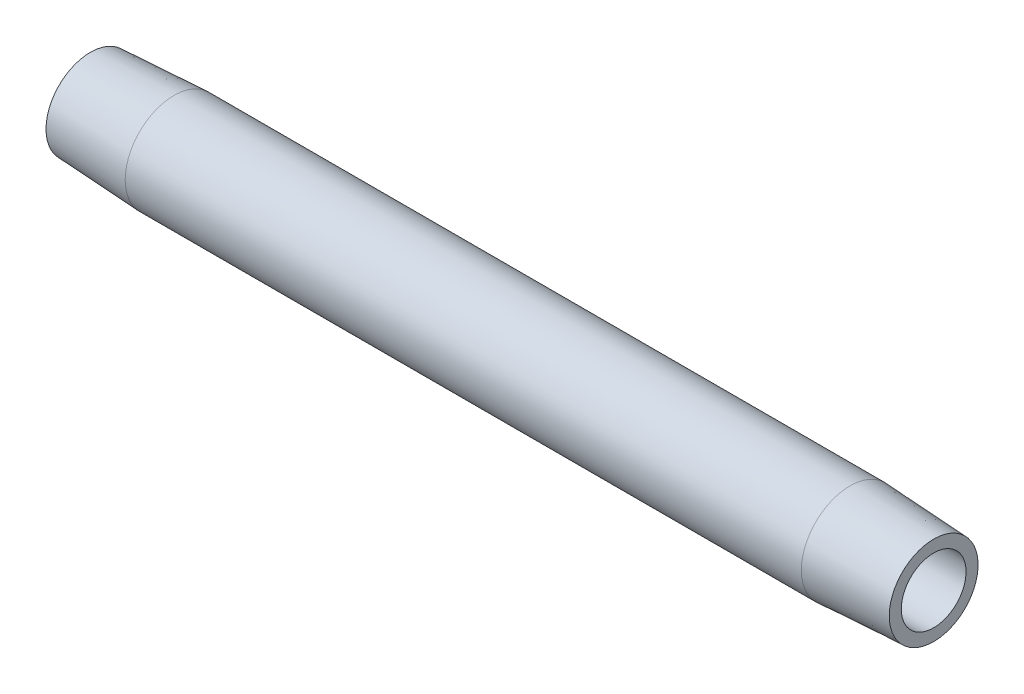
ISO-10303-21;
HEADER;
FILE_DESCRIPTION(('STEP AP214'),'2;1');
FILE_NAME('part.step','',(''),(''),'','','');
FILE_SCHEMA(('AUTOMOTIVE_DESIGN { 1 0 10303 214 1 1 1 1 }'));
ENDSEC;
DATA;
#1=APPLICATION_CONTEXT('core data for automotive mechanical design processes');
#2=APPLICATION_PROTOCOL_DEFINITION('international standard','automotive_design',2000,#1);
#3=PRODUCT_CONTEXT('',#1,'mechanical');
#4=PRODUCT('Part','Part','',(#3));
#5=PRODUCT_RELATED_PRODUCT_CATEGORY('part','',(#4));
#6=PRODUCT_DEFINITION_FORMATION('','',#4);
#7=PRODUCT_DEFINITION_CONTEXT('part definition',#1,'design');
#8=PRODUCT_DEFINITION('design','',#6,#7);
#9=PRODUCT_DEFINITION_SHAPE('','',#8);
#10=(LENGTH_UNIT() NAMED_UNIT(*) SI_UNIT(.MILLI.,.METRE.));
#11=(NAMED_UNIT(*) PLANE_ANGLE_UNIT() SI_UNIT($,.RADIAN.));
#12=(NAMED_UNIT(*) SI_UNIT($,.STERADIAN.) SOLID_ANGLE_UNIT());
#13=UNCERTAINTY_MEASURE_WITH_UNIT(LENGTH_MEASURE(1.E-05),#10,'distance_accuracy_value','');
#14=(GEOMETRIC_REPRESENTATION_CONTEXT(3) GLOBAL_UNCERTAINTY_ASSIGNED_CONTEXT((#13)) GLOBAL_UNIT_ASSIGNED_CONTEXT((#10,
#11,#12)) REPRESENTATION_CONTEXT('',''));
#15=CARTESIAN_POINT('',(0.,0.,0.));
#16=DIRECTION('',(0.,0.,1.));
#17=DIRECTION('',(1.,0.,0.));
#18=AXIS2_PLACEMENT_3D('',#15,#16,#17);
#19=CARTESIAN_POINT('',(0.476141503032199,0.,0.));
#20=DIRECTION('',(-1.,0.,0.));
#21=DIRECTION('',(0.,0.,1.));
#22=AXIS2_PLACEMENT_3D('',#19,#20,#21);
#23=CYLINDRICAL_SURFACE('',#22,5.14349999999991);
#24=CARTESIAN_POINT('',(8.8100393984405,0.,0.));
#25=DIRECTION('',(-1.,0.,0.));
#26=DIRECTION('',(0.,0.,1.));
#27=AXIS2_PLACEMENT_3D('',#24,#25,#26);
#28=CIRCLE('',#27,5.14349999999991);
#29=CARTESIAN_POINT('',(8.8100393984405,0.,5.14349999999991));
#30=VERTEX_POINT('',#29);
#31=EDGE_CURVE('E10',#30,#30,#28,.T.);
#32=ORIENTED_EDGE('',*,*,#31,.F.);
#33=EDGE_LOOP('',(#32));
#34=FACE_BOUND('',#33,.T.);
#35=CARTESIAN_POINT('',(80.0899606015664,0.,0.));
#36=DIRECTION('',(-1.,0.,0.));
#37=DIRECTION('',(0.,0.,1.));
#38=AXIS2_PLACEMENT_3D('',#35,#36,#37);
#39=CIRCLE('',#38,5.14349999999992);
#40=CARTESIAN_POINT('',(80.0899606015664,0.,5.14349999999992));
#41=VERTEX_POINT('',#40);
#42=EDGE_CURVE('E52',#41,#41,#39,.T.);
#43=ORIENTED_EDGE('',*,*,#42,.T.);
#44=EDGE_LOOP('',(#43));
#45=FACE_BOUND('',#44,.T.);
#46=ADVANCED_FACE('F30',(#34,#45),#23,.T.);
#47=CARTESIAN_POINT('',(8.8100393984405,0.,0.));
#48=DIRECTION('',(1.,0.,0.));
#49=DIRECTION('',(0.,0.,-1.));
#50=AXIS2_PLACEMENT_3D('',#47,#48,#49);
#51=CONICAL_SURFACE('',#50,5.14349999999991,0.0523598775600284);
#52=CARTESIAN_POINT('',(0.,0.,0.));
#53=DIRECTION('',(-1.,0.,0.));
#54=DIRECTION('',(0.,0.,1.));
#55=AXIS2_PLACEMENT_3D('',#52,#53,#54);
#56=CIRCLE('',#55,4.68178539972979);
#57=CARTESIAN_POINT('',(0.,0.,4.68178539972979));
#58=VERTEX_POINT('',#57);
#59=EDGE_CURVE('E36',#58,#58,#56,.T.);
#60=ORIENTED_EDGE('',*,*,#59,.F.);
#61=EDGE_LOOP('',(#60));
#62=FACE_BOUND('',#61,.T.);
#63=ORIENTED_EDGE('',*,*,#31,.T.);
#64=EDGE_LOOP('',(#63));
#65=FACE_BOUND('',#64,.T.);
#66=ADVANCED_FACE('F77',(#62,#65),#51,.T.);
#67=CARTESIAN_POINT('',(0.,4.68178539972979,0.));
#68=DIRECTION('',(1.,0.,0.));
#69=DIRECTION('',(0.,0.,-1.));
#70=AXIS2_PLACEMENT_3D('',#67,#68,#69);
#71=PLANE('',#70);
#72=CARTESIAN_POINT('',(0.,0.,0.));
#73=DIRECTION('',(-1.,0.,0.));
#74=DIRECTION('',(0.,0.,1.));
#75=AXIS2_PLACEMENT_3D('',#72,#73,#74);
#76=CIRCLE('',#75,3.4163);
#77=CARTESIAN_POINT('',(0.,0.,3.4163));
#78=VERTEX_POINT('',#77);
#79=EDGE_CURVE('E40',#78,#78,#76,.T.);
#80=ORIENTED_EDGE('',*,*,#79,.F.);
#81=EDGE_LOOP('',(#80));
#82=FACE_BOUND('',#81,.T.);
#83=ORIENTED_EDGE('',*,*,#59,.T.);
#84=EDGE_LOOP('',(#83));
#85=FACE_BOUND('',#84,.T.);
#86=ADVANCED_FACE('F72',(#82,#85),#71,.F.);
#87=CARTESIAN_POINT('',(0.476141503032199,0.,0.));
#88=DIRECTION('',(-1.,0.,0.));
#89=DIRECTION('',(0.,0.,1.));
#90=AXIS2_PLACEMENT_3D('',#87,#88,#89);
#91=CYLINDRICAL_SURFACE('',#90,3.4163);
#92=CARTESIAN_POINT('',(88.9,0.,0.));
#93=DIRECTION('',(-1.,0.,0.));
#94=DIRECTION('',(0.,0.,1.));
#95=AXIS2_PLACEMENT_3D('',#92,#93,#94);
#96=CIRCLE('',#95,3.41630000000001);
#97=CARTESIAN_POINT('',(88.9,0.,3.41630000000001));
#98=VERTEX_POINT('',#97);
#99=EDGE_CURVE('E44',#98,#98,#96,.T.);
#100=ORIENTED_EDGE('',*,*,#99,.F.);
#101=EDGE_LOOP('',(#100));
#102=FACE_BOUND('',#101,.T.);
#103=ORIENTED_EDGE('',*,*,#79,.T.);
#104=EDGE_LOOP('',(#103));
#105=FACE_BOUND('',#104,.T.);
#106=ADVANCED_FACE('F66',(#102,#105),#91,.F.);
#107=CARTESIAN_POINT('',(88.9,3.41630000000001,0.));
#108=DIRECTION('',(-1.,0.,0.));
#109=DIRECTION('',(0.,0.,1.));
#110=AXIS2_PLACEMENT_3D('',#107,#108,#109);
#111=PLANE('',#110);
#112=CARTESIAN_POINT('',(88.9,0.,0.));
#113=DIRECTION('',(-1.,0.,0.));
#114=DIRECTION('',(0.,0.,1.));
#115=AXIS2_PLACEMENT_3D('',#112,#113,#114);
#116=CIRCLE('',#115,4.68178539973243);
#117=CARTESIAN_POINT('',(88.9,0.,4.68178539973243));
#118=VERTEX_POINT('',#117);
#119=EDGE_CURVE('E49',#118,#118,#116,.T.);
#120=ORIENTED_EDGE('',*,*,#119,.F.);
#121=EDGE_LOOP('',(#120));
#122=FACE_BOUND('',#121,.T.);
#123=ORIENTED_EDGE('',*,*,#99,.T.);
#124=EDGE_LOOP('',(#123));
#125=FACE_BOUND('',#124,.T.);
#126=ADVANCED_FACE('F60',(#122,#125),#111,.F.);
#127=CARTESIAN_POINT('',(88.9,0.,0.));
#128=DIRECTION('',(-1.,0.,0.));
#129=DIRECTION('',(0.,0.,1.));
#130=AXIS2_PLACEMENT_3D('',#127,#128,#129);
#131=CONICAL_SURFACE('',#130,4.68178539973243,0.0523598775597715);
#132=ORIENTED_EDGE('',*,*,#42,.F.);
#133=EDGE_LOOP('',(#132));
#134=FACE_BOUND('',#133,.T.);
#135=ORIENTED_EDGE('',*,*,#119,.T.);
#136=EDGE_LOOP('',(#135));
#137=FACE_BOUND('',#136,.T.);
#138=ADVANCED_FACE('F57',(#134,#137),#131,.T.);
#139=CLOSED_SHELL('',(#46,#66,#86,#106,#126,#138));
#140=MANIFOLD_SOLID_BREP('B2',#139);
#141=ADVANCED_BREP_SHAPE_REPRESENTATION('',(#18,#140),#14);
#142=SHAPE_DEFINITION_REPRESENTATION(#9,#141);
ENDSEC;
END-ISO-10303-21;
